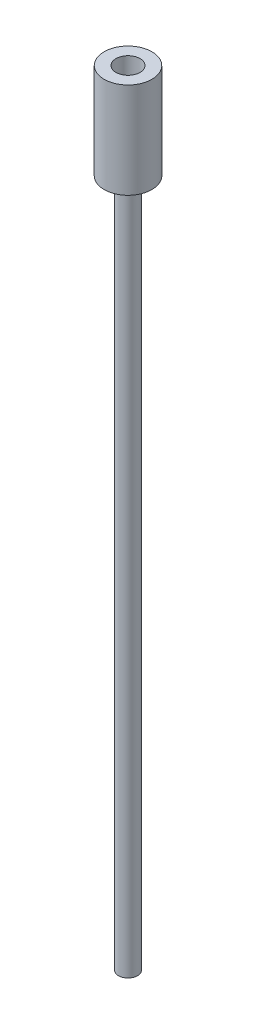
from build123d import *

# Parameters (mm, degrees)
BOSS_EXTRUDE1_DEPTH      = 6.35
BOSS_EXTRUDE1_DEPTH_BACK = 228.6
SKETCH1_R                = 3.175
SKETCH1_2_R              = 7.9375
SKETCH1_2_R_2            = 3.175
EXTRUDE_THIN1_DEPTH      = 31.75
CUT_EXTRUDE_THIN1_START  = 6.35
SKETCH1_3_R              = 4.000000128
SKETCH1_3_R_2            = 3.175
CUT_EXTRUDE_THIN1_DEPTH  = 223.525441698


with BuildPart() as part:
    # Sketch1 → Boss-Extrude1 (new, two sides: drawn at the far end of the back side and taken through both)
    with BuildSketch(Plane(origin=(0, 0, 0), x_dir=(1, 0, 0), z_dir=(0, 1, 0)).offset(-BOSS_EXTRUDE1_DEPTH_BACK)):
        with Locations(Location((0, 0, 0), (0, 0, 270))):
            Circle(SKETCH1_R)
    extrude(amount=BOSS_EXTRUDE1_DEPTH + BOSS_EXTRUDE1_DEPTH_BACK)

    # Sketch1_2 → Extrude-Thin1 (add)
    with BuildSketch(Plane(origin=(0, 0, 0), x_dir=(1, 0, 0), z_dir=(0, 1, 0))):
        Circle(SKETCH1_2_R)
        Circle(SKETCH1_2_R_2, mode=Mode.SUBTRACT)
    extrude(amount=EXTRUDE_THIN1_DEPTH)

    # Sketch1_3 → Cut-Extrude-Thin1 (cut, through all)
    with BuildSketch(Plane(origin=(0, 0, 0), x_dir=(1, 0, 0), z_dir=(0, 1, 0)).offset(CUT_EXTRUDE_THIN1_START)):
        Circle(SKETCH1_3_R)
        Circle(SKETCH1_3_R_2, mode=Mode.SUBTRACT)
    extrude(amount=CUT_EXTRUDE_THIN1_DEPTH, mode=Mode.SUBTRACT)


solid = part.part
